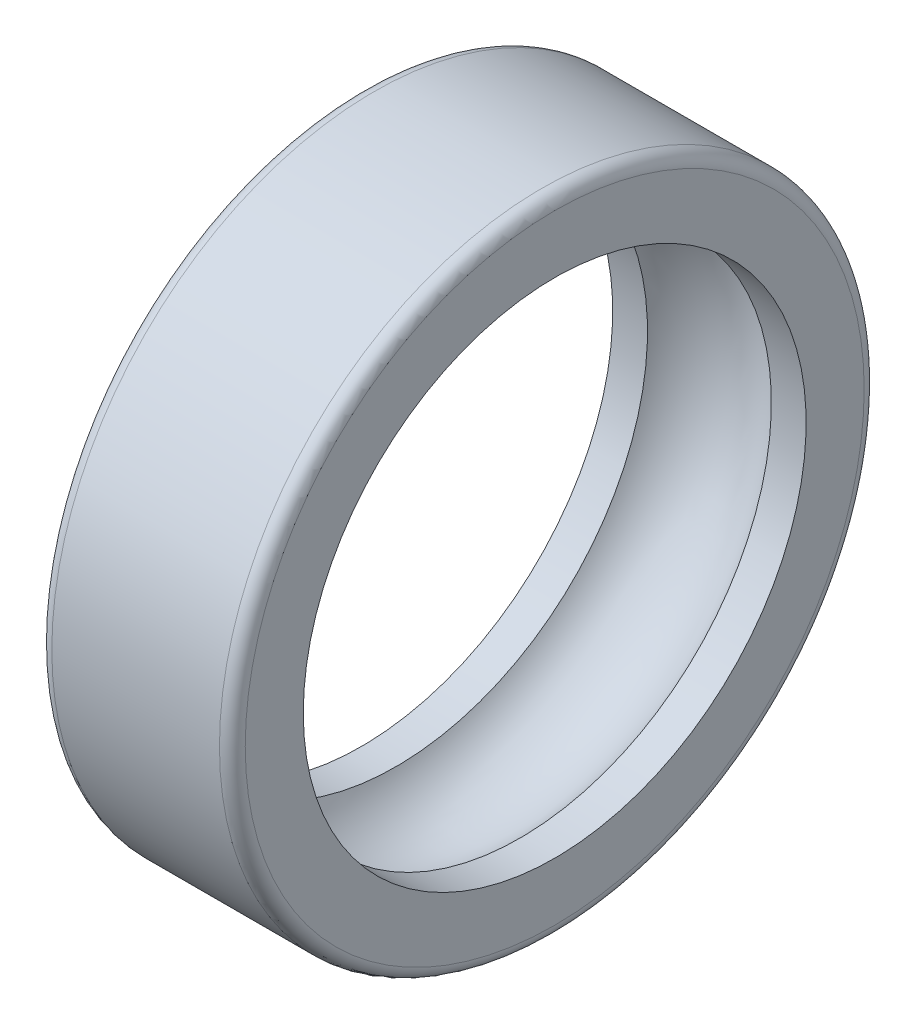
ISO-10303-21;
HEADER;
FILE_DESCRIPTION(('STEP AP214'),'2;1');
FILE_NAME('part.step','',(''),(''),'','','');
FILE_SCHEMA(('AUTOMOTIVE_DESIGN { 1 0 10303 214 1 1 1 1 }'));
ENDSEC;
DATA;
#1=APPLICATION_CONTEXT('core data for automotive mechanical design processes');
#2=APPLICATION_PROTOCOL_DEFINITION('international standard','automotive_design',2000,#1);
#3=PRODUCT_CONTEXT('',#1,'mechanical');
#4=PRODUCT('Part','Part','',(#3));
#5=PRODUCT_RELATED_PRODUCT_CATEGORY('part','',(#4));
#6=PRODUCT_DEFINITION_FORMATION('','',#4);
#7=PRODUCT_DEFINITION_CONTEXT('part definition',#1,'design');
#8=PRODUCT_DEFINITION('design','',#6,#7);
#9=PRODUCT_DEFINITION_SHAPE('','',#8);
#10=(LENGTH_UNIT() NAMED_UNIT(*) SI_UNIT(.MILLI.,.METRE.));
#11=(NAMED_UNIT(*) PLANE_ANGLE_UNIT() SI_UNIT($,.RADIAN.));
#12=(NAMED_UNIT(*) SI_UNIT($,.STERADIAN.) SOLID_ANGLE_UNIT());
#13=UNCERTAINTY_MEASURE_WITH_UNIT(LENGTH_MEASURE(1.E-05),#10,'distance_accuracy_value','');
#14=(GEOMETRIC_REPRESENTATION_CONTEXT(3) GLOBAL_UNCERTAINTY_ASSIGNED_CONTEXT((#13)) GLOBAL_UNIT_ASSIGNED_CONTEXT((#10,
#11,#12)) REPRESENTATION_CONTEXT('',''));
#15=CARTESIAN_POINT('',(0.,0.,0.));
#16=DIRECTION('',(0.,0.,1.));
#17=DIRECTION('',(1.,0.,0.));
#18=AXIS2_PLACEMENT_3D('',#15,#16,#17);
#19=CARTESIAN_POINT('',(0.,14.4,0.));
#20=DIRECTION('',(1.,0.,0.));
#21=DIRECTION('',(0.,0.,-1.));
#22=AXIS2_PLACEMENT_3D('',#19,#20,#21);
#23=PLANE('',#22);
#24=CARTESIAN_POINT('',(0.,0.,0.));
#25=DIRECTION('',(-1.,0.,0.));
#26=DIRECTION('',(0.,0.,1.));
#27=AXIS2_PLACEMENT_3D('',#24,#25,#26);
#28=CIRCLE('',#27,11.7);
#29=CARTESIAN_POINT('',(0.,0.,11.7));
#30=VERTEX_POINT('',#29);
#31=EDGE_CURVE('E10',#30,#30,#28,.T.);
#32=ORIENTED_EDGE('',*,*,#31,.F.);
#33=EDGE_LOOP('',(#32));
#34=FACE_BOUND('',#33,.T.);
#35=CARTESIAN_POINT('',(0.,0.,0.));
#36=DIRECTION('',(-1.,0.,0.));
#37=DIRECTION('',(0.,0.,1.));
#38=AXIS2_PLACEMENT_3D('',#35,#36,#37);
#39=CIRCLE('',#38,14.4);
#40=CARTESIAN_POINT('',(0.,0.,14.4));
#41=VERTEX_POINT('',#40);
#42=EDGE_CURVE('E43',#41,#41,#39,.T.);
#43=ORIENTED_EDGE('',*,*,#42,.T.);
#44=EDGE_LOOP('',(#43));
#45=FACE_BOUND('',#44,.T.);
#46=ADVANCED_FACE('F15',(#34,#45),#23,.F.);
#47=CARTESIAN_POINT('',(0.,0.,0.));
#48=DIRECTION('',(-1.,0.,0.));
#49=DIRECTION('',(0.,0.,1.));
#50=AXIS2_PLACEMENT_3D('',#47,#48,#49);
#51=CYLINDRICAL_SURFACE('',#50,11.7);
#52=CARTESIAN_POINT('',(1.61807597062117,0.,0.));
#53=DIRECTION('',(-1.,0.,0.));
#54=DIRECTION('',(0.,0.,1.));
#55=AXIS2_PLACEMENT_3D('',#52,#53,#54);
#56=CIRCLE('',#55,11.7);
#57=CARTESIAN_POINT('',(1.61807597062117,0.,11.7));
#58=VERTEX_POINT('',#57);
#59=EDGE_CURVE('E21',#58,#58,#56,.T.);
#60=ORIENTED_EDGE('',*,*,#59,.F.);
#61=EDGE_LOOP('',(#60));
#62=FACE_BOUND('',#61,.T.);
#63=ORIENTED_EDGE('',*,*,#31,.T.);
#64=EDGE_LOOP('',(#63));
#65=FACE_BOUND('',#64,.T.);
#66=ADVANCED_FACE('F80',(#62,#65),#51,.F.);
#67=CARTESIAN_POINT('',(4.5,0.,0.));
#68=DIRECTION('',(-1.,0.,0.));
#69=DIRECTION('',(0.,0.,1.));
#70=AXIS2_PLACEMENT_3D('',#67,#68,#69);
#71=TOROIDAL_SURFACE('',#70,10.025,3.33333333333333);
#72=ORIENTED_EDGE('',*,*,#59,.T.);
#73=EDGE_LOOP('',(#72));
#74=FACE_BOUND('',#73,.T.);
#75=CARTESIAN_POINT('',(7.38192402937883,0.,0.));
#76=DIRECTION('',(-1.,0.,0.));
#77=DIRECTION('',(0.,0.,1.));
#78=AXIS2_PLACEMENT_3D('',#75,#76,#77);
#79=CIRCLE('',#78,11.7);
#80=CARTESIAN_POINT('',(7.38192402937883,0.,11.7));
#81=VERTEX_POINT('',#80);
#82=EDGE_CURVE('E25',#81,#81,#79,.T.);
#83=ORIENTED_EDGE('',*,*,#82,.F.);
#84=EDGE_LOOP('',(#83));
#85=FACE_BOUND('',#84,.T.);
#86=ADVANCED_FACE('F75',(#74,#85),#71,.F.);
#87=CARTESIAN_POINT('',(0.,0.,0.));
#88=DIRECTION('',(-1.,0.,0.));
#89=DIRECTION('',(0.,0.,1.));
#90=AXIS2_PLACEMENT_3D('',#87,#88,#89);
#91=CYLINDRICAL_SURFACE('',#90,11.7);
#92=CARTESIAN_POINT('',(9.,0.,0.));
#93=DIRECTION('',(-1.,0.,0.));
#94=DIRECTION('',(0.,0.,1.));
#95=AXIS2_PLACEMENT_3D('',#92,#93,#94);
#96=CIRCLE('',#95,11.7);
#97=CARTESIAN_POINT('',(9.,0.,11.7));
#98=VERTEX_POINT('',#97);
#99=EDGE_CURVE('E29',#98,#98,#96,.T.);
#100=ORIENTED_EDGE('',*,*,#99,.F.);
#101=EDGE_LOOP('',(#100));
#102=FACE_BOUND('',#101,.T.);
#103=ORIENTED_EDGE('',*,*,#82,.T.);
#104=EDGE_LOOP('',(#103));
#105=FACE_BOUND('',#104,.T.);
#106=ADVANCED_FACE('F69',(#102,#105),#91,.F.);
#107=CARTESIAN_POINT('',(9.,11.7,0.));
#108=DIRECTION('',(-1.,0.,0.));
#109=DIRECTION('',(0.,0.,1.));
#110=AXIS2_PLACEMENT_3D('',#107,#108,#109);
#111=PLANE('',#110);
#112=CARTESIAN_POINT('',(9.,0.,0.));
#113=DIRECTION('',(-1.,0.,0.));
#114=DIRECTION('',(0.,0.,1.));
#115=AXIS2_PLACEMENT_3D('',#112,#113,#114);
#116=CIRCLE('',#115,14.4);
#117=CARTESIAN_POINT('',(9.,0.,14.4));
#118=VERTEX_POINT('',#117);
#119=EDGE_CURVE('E34',#118,#118,#116,.T.);
#120=ORIENTED_EDGE('',*,*,#119,.F.);
#121=EDGE_LOOP('',(#120));
#122=FACE_BOUND('',#121,.T.);
#123=ORIENTED_EDGE('',*,*,#99,.T.);
#124=EDGE_LOOP('',(#123));
#125=FACE_BOUND('',#124,.T.);
#126=ADVANCED_FACE('F63',(#122,#125),#111,.F.);
#127=CARTESIAN_POINT('',(8.4,0.,0.));
#128=DIRECTION('',(-1.,0.,0.));
#129=DIRECTION('',(0.,0.,1.));
#130=AXIS2_PLACEMENT_3D('',#127,#128,#129);
#131=TOROIDAL_SURFACE('',#130,14.4,0.6);
#132=CARTESIAN_POINT('',(8.4,0.,0.));
#133=DIRECTION('',(-1.,0.,0.));
#134=DIRECTION('',(0.,0.,1.));
#135=AXIS2_PLACEMENT_3D('',#132,#133,#134);
#136=CIRCLE('',#135,15.);
#137=CARTESIAN_POINT('',(8.4,0.,15.));
#138=VERTEX_POINT('',#137);
#139=EDGE_CURVE('E37',#138,#138,#136,.T.);
#140=ORIENTED_EDGE('',*,*,#139,.F.);
#141=EDGE_LOOP('',(#140));
#142=FACE_BOUND('',#141,.T.);
#143=ORIENTED_EDGE('',*,*,#119,.T.);
#144=EDGE_LOOP('',(#143));
#145=FACE_BOUND('',#144,.T.);
#146=ADVANCED_FACE('F57',(#142,#145),#131,.T.);
#147=CARTESIAN_POINT('',(0.,0.,0.));
#148=DIRECTION('',(-1.,0.,0.));
#149=DIRECTION('',(0.,0.,1.));
#150=AXIS2_PLACEMENT_3D('',#147,#148,#149);
#151=CYLINDRICAL_SURFACE('',#150,15.);
#152=CARTESIAN_POINT('',(0.6,0.,0.));
#153=DIRECTION('',(-1.,0.,0.));
#154=DIRECTION('',(0.,0.,1.));
#155=AXIS2_PLACEMENT_3D('',#152,#153,#154);
#156=CIRCLE('',#155,15.);
#157=CARTESIAN_POINT('',(0.6,0.,15.));
#158=VERTEX_POINT('',#157);
#159=EDGE_CURVE('E40',#158,#158,#156,.T.);
#160=ORIENTED_EDGE('',*,*,#159,.F.);
#161=EDGE_LOOP('',(#160));
#162=FACE_BOUND('',#161,.T.);
#163=ORIENTED_EDGE('',*,*,#139,.T.);
#164=EDGE_LOOP('',(#163));
#165=FACE_BOUND('',#164,.T.);
#166=ADVANCED_FACE('F51',(#162,#165),#151,.T.);
#167=CARTESIAN_POINT('',(0.6,0.,0.));
#168=DIRECTION('',(-1.,0.,0.));
#169=DIRECTION('',(0.,0.,1.));
#170=AXIS2_PLACEMENT_3D('',#167,#168,#169);
#171=TOROIDAL_SURFACE('',#170,14.4,0.6);
#172=ORIENTED_EDGE('',*,*,#42,.F.);
#173=EDGE_LOOP('',(#172));
#174=FACE_BOUND('',#173,.T.);
#175=ORIENTED_EDGE('',*,*,#159,.T.);
#176=EDGE_LOOP('',(#175));
#177=FACE_BOUND('',#176,.T.);
#178=ADVANCED_FACE('F48',(#174,#177),#171,.T.);
#179=CLOSED_SHELL('',(#46,#66,#86,#106,#126,#146,#166,#178));
#180=MANIFOLD_SOLID_BREP('B1',#179);
#181=ADVANCED_BREP_SHAPE_REPRESENTATION('',(#18,#180),#14);
#182=SHAPE_DEFINITION_REPRESENTATION(#9,#181);
ENDSEC;
END-ISO-10303-21;
